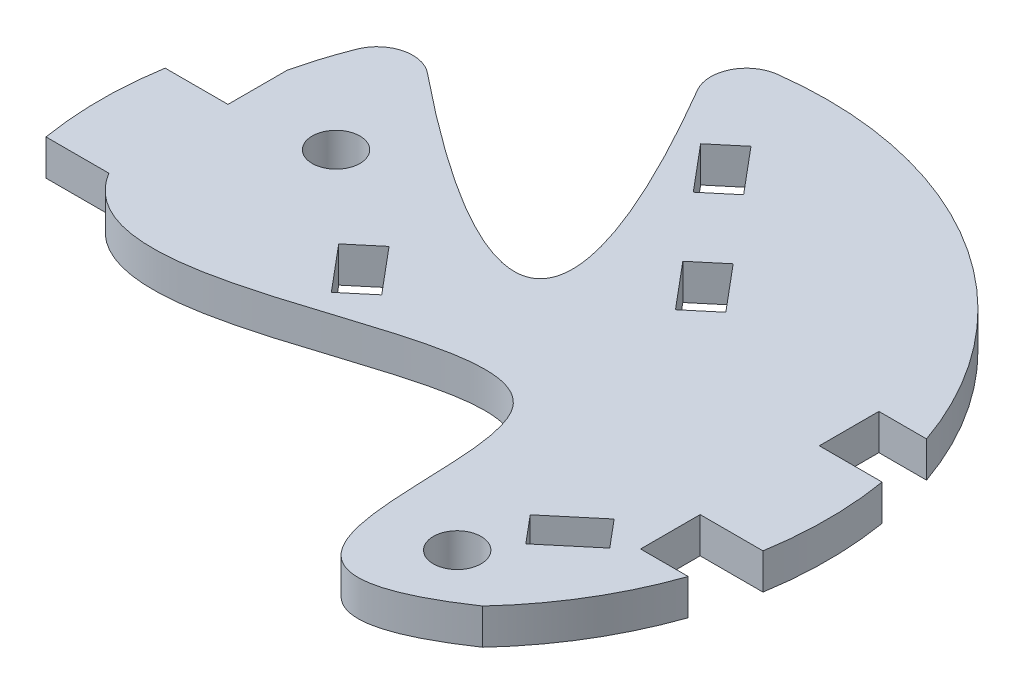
from build123d import *

# Parameters (mm, degrees)
CROQUIS1_R              = 30.5
SALIENTE_EXTRUIR1_DEPTH = 3
CORTAR_EXTRUIR3_START   = -4
CORTAR_EXTRUIR3_DEPTH   = 4
CORTAR_EXTRUIR6_START   = -10
CROQUIS9_R              = 2
CORTAR_EXTRUIR6_DEPTH   = 10
REDONDEO1_R             = 3


with BuildPart() as part:
    # Croquis1 → Saliente-Extruir1 (new body)
    with BuildSketch(Plane(origin=(0, 0, 0), x_dir=(1, 0, 0), z_dir=(0, 1, 0))):
        with Locations(Location((0, 0, 0), (0, 0, 270))):
            Circle(CROQUIS1_R)
    extrude(amount=SALIENTE_EXTRUIR1_DEPTH)

    # Croquis5 → Cortar-Extruir3 (cut)
    with BuildSketch(Plane(origin=(0, 3, 0), x_dir=(1, 0, 0), z_dir=(0, 1, 0)).offset(CORTAR_EXTRUIR3_START)):
        with BuildLine():
            Line((28.814059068, 5), (30.087372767, 5))
            ThreePointArc((30.087372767, 5), (29.556634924, 7.526973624), (28.814059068, 10))
            Line((28.814059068, 10), (24.814059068, 10))
            Line((24.814059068, 10), (24.814059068, 5))
            Line((24.814059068, 5), (28.814059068, 5))
        make_face()
        with BuildLine():
            Line((30.087372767, -5), (28.814059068, -5))
            Line((28.814059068, -5), (24.814059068, -5))
            Line((24.814059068, -5), (24.814059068, -10))
            Line((24.814059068, -10), (28.814059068, -10))
            ThreePointArc((28.814059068, -10), (29.556634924, -7.526973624), (30.087372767, -5))
        make_face()
        with BuildLine():
            Line((-24.814059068, 5), (-24.814059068, 10))
            Line((-24.814059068, 10), (-28.814059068, 10))
            ThreePointArc((-28.814059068, 10), (-29.556634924, 7.526973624), (-30.087372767, 5))
            Line((-30.087372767, 5), (-28.814059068, 5))
            Line((-28.814059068, 5), (-24.814059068, 5))
        make_face()
        with BuildLine():
            Line((-28.814059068, -10), (-24.814059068, -10))
            Line((-24.814059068, -10), (-24.814059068, -5))
            Line((-24.814059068, -5), (-28.814059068, -5))
            Line((-28.814059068, -5), (-30.087372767, -5))
            ThreePointArc((-30.087372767, -5), (-29.556634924, -7.526973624), (-28.814059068, -10))
        make_face()
    extrude(amount=CORTAR_EXTRUIR3_DEPTH, mode=Mode.SUBTRACT)

    # Croquis9 → Cortar-Extruir6 (cut)
    with BuildSketch(Plane(origin=(0, 3, 0), x_dir=(1, 0, 0), z_dir=(0, 1, 0)).offset(CORTAR_EXTRUIR6_START)):
        Polygon((5.673284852, 12.685390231), (8.887222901, 8.855168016), (11.18535623, 10.783530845), (7.971418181, 14.613753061), align=None)
        with BuildLine():
            add(Edge.make_bspline(
                [(22.328940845, -20.776631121), (5.973751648, -31.851207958), (22.176782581, 15.835204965), (-18.206868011, -15.807645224), (-24.814059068, -5)],
                knots=[0, 0, 0, 0, 0.445790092, 1, 1, 1, 1], degree=3))
            Line((-24.814059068, -5), (-24.814059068, -10))
            Line((-24.814059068, -10), (-28.814059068, -10))
            ThreePointArc((-28.814059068, -10), (-6.288730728, -29.84462876), (22.328940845, -20.776631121))
        make_face()
        with BuildLine():
            add(Edge.make_bspline(
                [(-18.745320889, 15.664553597), (3.867000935, -2.576496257), (8.094246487, 2.496379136), (-8.307345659, 29.346856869)],
                knots=[0.040527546, 0.040527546, 0.040527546, 0.040527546, 1, 1, 1, 1], degree=3))
            ThreePointArc((-8.307345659, 29.346856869), (-20.930238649, 22.185019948), (-28.814059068, 10))
            Line((-28.814059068, 10), (-24.814059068, 10))
            add(Edge.make_bspline(
                [(-24.814059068, 10), (-24.456478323, 11.504954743), (-23.99064654, 12.985671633), (-23.418905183, 14.432273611)],
                knots=[0.635079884, 0.635079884, 0.635079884, 0.635079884, 0.831813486, 0.831813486, 0.831813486, 0.831813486], degree=3))
            ThreePointArc((-23.418905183, 14.432273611), (-21.393777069, 16.230440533), (-18.745320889, 15.664553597))
        make_face()
        Polygon((-2.120514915, 21.973679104), (1.093423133, 18.143456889), (3.391556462, 20.071819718), (0.177618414, 23.902041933), align=None)
        Polygon((-4.518554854, -2.393615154), (-7.732492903, 1.436607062), (-10.030626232, -0.491755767), (-6.816688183, -4.321977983), align=None)
        Polygon((23.455638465, -11.229310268), (21.527275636, -8.931176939), (17.69705342, -12.145114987), (19.625416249, -14.443248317), align=None)
        with Locations(Location((-16.983501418, 6.238634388, 0), (0, 0, 270))):
            Circle(CROQUIS9_R)
        with Locations(Location((17.204026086, -17.780443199, 0), (0, 0, 270))):
            Circle(CROQUIS9_R)
    extrude(amount=CORTAR_EXTRUIR6_DEPTH, mode=Mode.SUBTRACT)

    # Redondeo1
    redondeo1_edges = [part.edges().sort_by_distance(p)[0] for p in [
        (-8.307345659, 1.5, -29.346856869),
    ]]
    fillet(redondeo1_edges, radius=REDONDEO1_R)


solid = part.part
